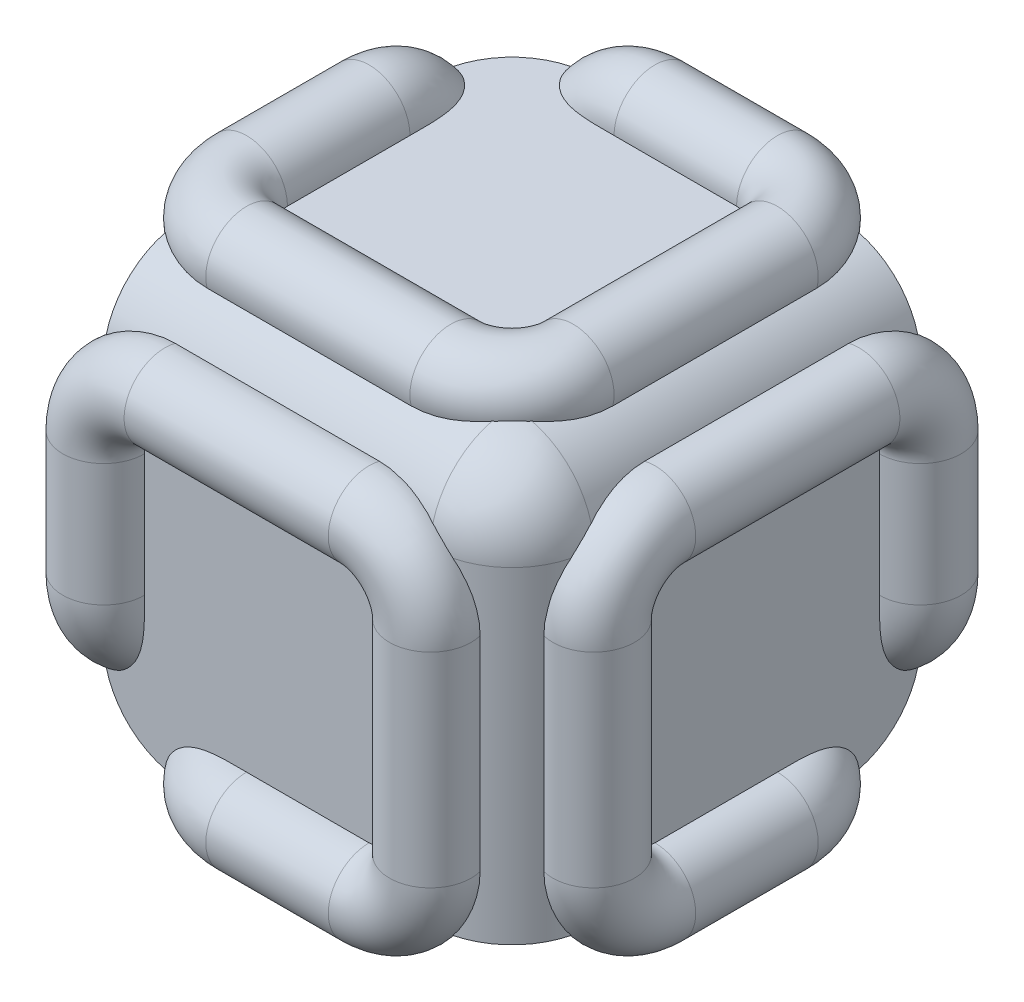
ISO-10303-21;
HEADER;
FILE_DESCRIPTION(('STEP AP214'),'2;1');
FILE_NAME('part.step','',(''),(''),'','','');
FILE_SCHEMA(('AUTOMOTIVE_DESIGN { 1 0 10303 214 1 1 1 1 }'));
ENDSEC;
DATA;
#1=APPLICATION_CONTEXT('core data for automotive mechanical design processes');
#2=APPLICATION_PROTOCOL_DEFINITION('international standard','automotive_design',2000,#1);
#3=PRODUCT_CONTEXT('',#1,'mechanical');
#4=PRODUCT('Part','Part','',(#3));
#5=PRODUCT_RELATED_PRODUCT_CATEGORY('part','',(#4));
#6=PRODUCT_DEFINITION_FORMATION('','',#4);
#7=PRODUCT_DEFINITION_CONTEXT('part definition',#1,'design');
#8=PRODUCT_DEFINITION('design','',#6,#7);
#9=PRODUCT_DEFINITION_SHAPE('','',#8);
#10=(LENGTH_UNIT() NAMED_UNIT(*) SI_UNIT(.MILLI.,.METRE.));
#11=(NAMED_UNIT(*) PLANE_ANGLE_UNIT() SI_UNIT($,.RADIAN.));
#12=(NAMED_UNIT(*) SI_UNIT($,.STERADIAN.) SOLID_ANGLE_UNIT());
#13=UNCERTAINTY_MEASURE_WITH_UNIT(LENGTH_MEASURE(1.E-05),#10,'distance_accuracy_value','');
#14=(GEOMETRIC_REPRESENTATION_CONTEXT(3) GLOBAL_UNCERTAINTY_ASSIGNED_CONTEXT((#13)) GLOBAL_UNIT_ASSIGNED_CONTEXT((#10,
#11,#12)) REPRESENTATION_CONTEXT('',''));
#15=CARTESIAN_POINT('',(0.,0.,0.));
#16=DIRECTION('',(0.,0.,1.));
#17=DIRECTION('',(1.,0.,0.));
#18=AXIS2_PLACEMENT_3D('',#15,#16,#17);
#19=CARTESIAN_POINT('',(20.,35.,-100.));
#20=DIRECTION('',(0.,1.,0.));
#21=DIRECTION('',(0.,0.,1.));
#22=AXIS2_PLACEMENT_3D('',#19,#20,#21);
#23=CYLINDRICAL_SURFACE('',#22,10.);
#24=CARTESIAN_POINT('',(20.,85.,-100.));
#25=DIRECTION('',(0.,-1.,0.));
#26=DIRECTION('',(0.,0.,-1.));
#27=AXIS2_PLACEMENT_3D('',#24,#25,#26);
#28=CIRCLE('',#27,10.);
#29=CARTESIAN_POINT('',(10.,85.,-100.));
#30=VERTEX_POINT('',#29);
#31=EDGE_CURVE('E153',#30,#30,#28,.T.);
#32=ORIENTED_EDGE('',*,*,#31,.T.);
#33=EDGE_LOOP('',(#32));
#34=FACE_BOUND('',#33,.T.);
#35=CARTESIAN_POINT('',(20.,35.,-100.));
#36=DIRECTION('',(0.,-1.,0.));
#37=DIRECTION('',(0.,0.,-1.));
#38=AXIS2_PLACEMENT_3D('',#35,#36,#37);
#39=CIRCLE('',#38,10.);
#40=CARTESIAN_POINT('',(10.,35.,-100.));
#41=VERTEX_POINT('',#40);
#42=EDGE_CURVE('E156',#41,#41,#39,.T.);
#43=ORIENTED_EDGE('',*,*,#42,.F.);
#44=EDGE_LOOP('',(#43));
#45=FACE_BOUND('',#44,.T.);
#46=ADVANCED_FACE('F43',(#34,#45),#23,.T.);
#47=CARTESIAN_POINT('',(35.,85.,-100.));
#48=DIRECTION('',(0.,0.,-1.));
#49=DIRECTION('',(-1.,0.,0.));
#50=AXIS2_PLACEMENT_3D('',#47,#48,#49);
#51=TOROIDAL_SURFACE('',#50,15.,10.);
#52=CARTESIAN_POINT('',(35.,100.,-100.));
#53=DIRECTION('',(-1.,0.,0.));
#54=DIRECTION('',(0.,0.,-1.));
#55=AXIS2_PLACEMENT_3D('',#52,#53,#54);
#56=CIRCLE('',#55,10.);
#57=CARTESIAN_POINT('',(35.,110.,-100.));
#58=VERTEX_POINT('',#57);
#59=EDGE_CURVE('E150',#58,#58,#56,.T.);
#60=CARTESIAN_POINT('',(35.,85.,-100.));
#61=DIRECTION('',(0.,0.,-1.));
#62=DIRECTION('',(-1.,0.,0.));
#63=AXIS2_PLACEMENT_3D('',#60,#61,#62);
#64=CIRCLE('',#63,25.);
#65=EDGE_CURVE('',#30,#58,#64,.T.);
#66=ORIENTED_EDGE('',*,*,#31,.F.);
#67=ORIENTED_EDGE('',*,*,#59,.T.);
#68=ORIENTED_EDGE('',*,*,#65,.T.);
#69=ORIENTED_EDGE('',*,*,#65,.F.);
#70=EDGE_LOOP('',(#66,#68,#67,#69));
#71=FACE_BOUND('',#70,.T.);
#72=ADVANCED_FACE('F163',(#71),#51,.T.);
#73=CARTESIAN_POINT('',(35.,100.,-100.));
#74=DIRECTION('',(1.,0.,0.));
#75=DIRECTION('',(0.,0.,-1.));
#76=AXIS2_PLACEMENT_3D('',#73,#74,#75);
#77=CYLINDRICAL_SURFACE('',#76,10.);
#78=CARTESIAN_POINT('',(65.,100.,-100.));
#79=DIRECTION('',(-1.,0.,0.));
#80=DIRECTION('',(0.,0.,-1.));
#81=AXIS2_PLACEMENT_3D('',#78,#79,#80);
#82=CIRCLE('',#81,10.);
#83=CARTESIAN_POINT('',(65.,100.,-110.));
#84=VERTEX_POINT('',#83);
#85=EDGE_CURVE('E147',#84,#84,#82,.T.);
#86=ORIENTED_EDGE('',*,*,#85,.T.);
#87=EDGE_LOOP('',(#86));
#88=FACE_BOUND('',#87,.T.);
#89=ORIENTED_EDGE('',*,*,#59,.F.);
#90=EDGE_LOOP('',(#89));
#91=FACE_BOUND('',#90,.T.);
#92=ADVANCED_FACE('F169',(#88,#91),#77,.T.);
#93=CARTESIAN_POINT('',(65.,100.,-85.));
#94=DIRECTION('',(0.,-1.,0.));
#95=DIRECTION('',(0.,0.,-1.));
#96=AXIS2_PLACEMENT_3D('',#93,#94,#95);
#97=TOROIDAL_SURFACE('',#96,15.,10.);
#98=CARTESIAN_POINT('',(80.,100.,-85.));
#99=DIRECTION('',(0.,0.,-1.));
#100=DIRECTION('',(1.,0.,0.));
#101=AXIS2_PLACEMENT_3D('',#98,#99,#100);
#102=CIRCLE('',#101,10.);
#103=CARTESIAN_POINT('',(90.,100.,-85.));
#104=VERTEX_POINT('',#103);
#105=EDGE_CURVE('E144',#104,#104,#102,.T.);
#106=CARTESIAN_POINT('',(65.,100.,-85.));
#107=DIRECTION('',(0.,-1.,0.));
#108=DIRECTION('',(0.,0.,-1.));
#109=AXIS2_PLACEMENT_3D('',#106,#107,#108);
#110=CIRCLE('',#109,25.);
#111=EDGE_CURVE('',#84,#104,#110,.T.);
#112=ORIENTED_EDGE('',*,*,#85,.F.);
#113=ORIENTED_EDGE('',*,*,#105,.T.);
#114=ORIENTED_EDGE('',*,*,#111,.T.);
#115=ORIENTED_EDGE('',*,*,#111,.F.);
#116=EDGE_LOOP('',(#112,#114,#113,#115));
#117=FACE_BOUND('',#116,.T.);
#118=ADVANCED_FACE('F175',(#117),#97,.T.);
#119=CARTESIAN_POINT('',(80.,100.,-85.));
#120=DIRECTION('',(0.,0.,1.));
#121=DIRECTION('',(1.,0.,0.));
#122=AXIS2_PLACEMENT_3D('',#119,#120,#121);
#123=CYLINDRICAL_SURFACE('',#122,10.);
#124=CARTESIAN_POINT('',(80.,100.,-35.));
#125=DIRECTION('',(0.,0.,-1.));
#126=DIRECTION('',(1.,0.,0.));
#127=AXIS2_PLACEMENT_3D('',#124,#125,#126);
#128=CIRCLE('',#127,10.);
#129=CARTESIAN_POINT('',(90.,100.,-35.));
#130=VERTEX_POINT('',#129);
#131=EDGE_CURVE('E141',#130,#130,#128,.T.);
#132=ORIENTED_EDGE('',*,*,#131,.T.);
#133=EDGE_LOOP('',(#132));
#134=FACE_BOUND('',#133,.T.);
#135=ORIENTED_EDGE('',*,*,#105,.F.);
#136=EDGE_LOOP('',(#135));
#137=FACE_BOUND('',#136,.T.);
#138=ADVANCED_FACE('F179',(#134,#137),#123,.T.);
#139=CARTESIAN_POINT('',(65.,100.,-35.));
#140=DIRECTION('',(0.,-1.,0.));
#141=DIRECTION('',(0.,0.,-1.));
#142=AXIS2_PLACEMENT_3D('',#139,#140,#141);
#143=TOROIDAL_SURFACE('',#142,15.,10.);
#144=CARTESIAN_POINT('',(65.,100.,-20.));
#145=DIRECTION('',(1.,0.,0.));
#146=DIRECTION('',(0.,0.,1.));
#147=AXIS2_PLACEMENT_3D('',#144,#145,#146);
#148=CIRCLE('',#147,10.);
#149=CARTESIAN_POINT('',(65.,100.,-10.));
#150=VERTEX_POINT('',#149);
#151=EDGE_CURVE('E138',#150,#150,#148,.T.);
#152=CARTESIAN_POINT('',(65.,100.,-35.));
#153=DIRECTION('',(0.,-1.,0.));
#154=DIRECTION('',(0.,0.,-1.));
#155=AXIS2_PLACEMENT_3D('',#152,#153,#154);
#156=CIRCLE('',#155,25.);
#157=EDGE_CURVE('',#130,#150,#156,.T.);
#158=ORIENTED_EDGE('',*,*,#131,.F.);
#159=ORIENTED_EDGE('',*,*,#151,.T.);
#160=ORIENTED_EDGE('',*,*,#157,.T.);
#161=ORIENTED_EDGE('',*,*,#157,.F.);
#162=EDGE_LOOP('',(#158,#160,#159,#161));
#163=FACE_BOUND('',#162,.T.);
#164=ADVANCED_FACE('F183',(#163),#143,.T.);
#165=CARTESIAN_POINT('',(65.,100.,-20.));
#166=DIRECTION('',(-1.,0.,0.));
#167=DIRECTION('',(0.,0.,1.));
#168=AXIS2_PLACEMENT_3D('',#165,#166,#167);
#169=CYLINDRICAL_SURFACE('',#168,10.);
#170=CARTESIAN_POINT('',(15.,100.,-20.));
#171=DIRECTION('',(1.,0.,0.));
#172=DIRECTION('',(0.,0.,1.));
#173=AXIS2_PLACEMENT_3D('',#170,#171,#172);
#174=CIRCLE('',#173,10.);
#175=CARTESIAN_POINT('',(15.,100.,-10.));
#176=VERTEX_POINT('',#175);
#177=EDGE_CURVE('E135',#176,#176,#174,.T.);
#178=ORIENTED_EDGE('',*,*,#177,.T.);
#179=EDGE_LOOP('',(#178));
#180=FACE_BOUND('',#179,.T.);
#181=ORIENTED_EDGE('',*,*,#151,.F.);
#182=EDGE_LOOP('',(#181));
#183=FACE_BOUND('',#182,.T.);
#184=ADVANCED_FACE('F187',(#180,#183),#169,.T.);
#185=CARTESIAN_POINT('',(15.,100.,-35.));
#186=DIRECTION('',(0.,-1.,0.));
#187=DIRECTION('',(0.,0.,-1.));
#188=AXIS2_PLACEMENT_3D('',#185,#186,#187);
#189=TOROIDAL_SURFACE('',#188,15.,10.);
#190=CARTESIAN_POINT('',(0.,100.,-35.));
#191=DIRECTION('',(0.,0.,1.));
#192=DIRECTION('',(-1.,0.,0.));
#193=AXIS2_PLACEMENT_3D('',#190,#191,#192);
#194=CIRCLE('',#193,10.);
#195=CARTESIAN_POINT('',(-10.,100.,-35.));
#196=VERTEX_POINT('',#195);
#197=EDGE_CURVE('E132',#196,#196,#194,.T.);
#198=CARTESIAN_POINT('',(15.,100.,-35.));
#199=DIRECTION('',(0.,-1.,0.));
#200=DIRECTION('',(0.,0.,-1.));
#201=AXIS2_PLACEMENT_3D('',#198,#199,#200);
#202=CIRCLE('',#201,25.);
#203=EDGE_CURVE('',#176,#196,#202,.T.);
#204=ORIENTED_EDGE('',*,*,#177,.F.);
#205=ORIENTED_EDGE('',*,*,#197,.T.);
#206=ORIENTED_EDGE('',*,*,#203,.T.);
#207=ORIENTED_EDGE('',*,*,#203,.F.);
#208=EDGE_LOOP('',(#204,#206,#205,#207));
#209=FACE_BOUND('',#208,.T.);
#210=ADVANCED_FACE('F191',(#209),#189,.T.);
#211=CARTESIAN_POINT('',(0.,100.,-35.));
#212=DIRECTION('',(0.,0.,-1.));
#213=DIRECTION('',(-1.,0.,0.));
#214=AXIS2_PLACEMENT_3D('',#211,#212,#213);
#215=CYLINDRICAL_SURFACE('',#214,10.);
#216=CARTESIAN_POINT('',(0.,100.,-65.));
#217=DIRECTION('',(0.,0.,1.));
#218=DIRECTION('',(-1.,0.,0.));
#219=AXIS2_PLACEMENT_3D('',#216,#217,#218);
#220=CIRCLE('',#219,10.);
#221=CARTESIAN_POINT('',(0.,110.,-65.));
#222=VERTEX_POINT('',#221);
#223=EDGE_CURVE('E129',#222,#222,#220,.T.);
#224=ORIENTED_EDGE('',*,*,#223,.T.);
#225=EDGE_LOOP('',(#224));
#226=FACE_BOUND('',#225,.T.);
#227=ORIENTED_EDGE('',*,*,#197,.F.);
#228=EDGE_LOOP('',(#227));
#229=FACE_BOUND('',#228,.T.);
#230=ADVANCED_FACE('F195',(#226,#229),#215,.T.);
#231=CARTESIAN_POINT('',(0.,85.,-65.));
#232=DIRECTION('',(-1.,0.,0.));
#233=DIRECTION('',(0.,0.,1.));
#234=AXIS2_PLACEMENT_3D('',#231,#232,#233);
#235=TOROIDAL_SURFACE('',#234,15.,10.);
#236=CARTESIAN_POINT('',(0.,85.,-80.));
#237=DIRECTION('',(0.,1.,0.));
#238=DIRECTION('',(-1.,0.,0.));
#239=AXIS2_PLACEMENT_3D('',#236,#237,#238);
#240=CIRCLE('',#239,10.);
#241=CARTESIAN_POINT('',(0.,85.,-90.));
#242=VERTEX_POINT('',#241);
#243=EDGE_CURVE('E126',#242,#242,#240,.T.);
#244=CARTESIAN_POINT('',(0.,85.,-65.));
#245=DIRECTION('',(-1.,0.,0.));
#246=DIRECTION('',(0.,0.,1.));
#247=AXIS2_PLACEMENT_3D('',#244,#245,#246);
#248=CIRCLE('',#247,25.);
#249=EDGE_CURVE('',#222,#242,#248,.T.);
#250=ORIENTED_EDGE('',*,*,#223,.F.);
#251=ORIENTED_EDGE('',*,*,#243,.T.);
#252=ORIENTED_EDGE('',*,*,#249,.T.);
#253=ORIENTED_EDGE('',*,*,#249,.F.);
#254=EDGE_LOOP('',(#250,#252,#251,#253));
#255=FACE_BOUND('',#254,.T.);
#256=ADVANCED_FACE('F199',(#255),#235,.T.);
#257=CARTESIAN_POINT('',(0.,85.,-80.));
#258=DIRECTION('',(0.,-1.,0.));
#259=DIRECTION('',(0.,0.,-1.));
#260=AXIS2_PLACEMENT_3D('',#257,#258,#259);
#261=CYLINDRICAL_SURFACE('',#260,10.);
#262=CARTESIAN_POINT('',(0.,35.,-80.));
#263=DIRECTION('',(0.,1.,0.));
#264=DIRECTION('',(-1.,0.,0.));
#265=AXIS2_PLACEMENT_3D('',#262,#263,#264);
#266=CIRCLE('',#265,10.);
#267=CARTESIAN_POINT('',(0.,35.,-90.));
#268=VERTEX_POINT('',#267);
#269=EDGE_CURVE('E123',#268,#268,#266,.T.);
#270=ORIENTED_EDGE('',*,*,#269,.T.);
#271=EDGE_LOOP('',(#270));
#272=FACE_BOUND('',#271,.T.);
#273=ORIENTED_EDGE('',*,*,#243,.F.);
#274=EDGE_LOOP('',(#273));
#275=FACE_BOUND('',#274,.T.);
#276=ADVANCED_FACE('F203',(#272,#275),#261,.T.);
#277=CARTESIAN_POINT('',(0.,35.,-65.));
#278=DIRECTION('',(-1.,0.,0.));
#279=DIRECTION('',(0.,0.,1.));
#280=AXIS2_PLACEMENT_3D('',#277,#278,#279);
#281=TOROIDAL_SURFACE('',#280,15.,10.);
#282=CARTESIAN_POINT('',(0.,20.,-65.));
#283=DIRECTION('',(0.,0.,-1.));
#284=DIRECTION('',(-1.,0.,0.));
#285=AXIS2_PLACEMENT_3D('',#282,#283,#284);
#286=CIRCLE('',#285,10.);
#287=CARTESIAN_POINT('',(0.,10.,-65.));
#288=VERTEX_POINT('',#287);
#289=EDGE_CURVE('E120',#288,#288,#286,.T.);
#290=CARTESIAN_POINT('',(0.,35.,-65.));
#291=DIRECTION('',(-1.,0.,0.));
#292=DIRECTION('',(0.,0.,1.));
#293=AXIS2_PLACEMENT_3D('',#290,#291,#292);
#294=CIRCLE('',#293,25.);
#295=EDGE_CURVE('',#268,#288,#294,.T.);
#296=ORIENTED_EDGE('',*,*,#269,.F.);
#297=ORIENTED_EDGE('',*,*,#289,.T.);
#298=ORIENTED_EDGE('',*,*,#295,.T.);
#299=ORIENTED_EDGE('',*,*,#295,.F.);
#300=EDGE_LOOP('',(#296,#298,#297,#299));
#301=FACE_BOUND('',#300,.T.);
#302=ADVANCED_FACE('F207',(#301),#281,.T.);
#303=CARTESIAN_POINT('',(0.,20.,-65.));
#304=DIRECTION('',(0.,0.,1.));
#305=DIRECTION('',(1.,0.,0.));
#306=AXIS2_PLACEMENT_3D('',#303,#304,#305);
#307=CYLINDRICAL_SURFACE('',#306,10.);
#308=CARTESIAN_POINT('',(0.,20.,-15.));
#309=DIRECTION('',(0.,0.,-1.));
#310=DIRECTION('',(-1.,0.,0.));
#311=AXIS2_PLACEMENT_3D('',#308,#309,#310);
#312=CIRCLE('',#311,10.);
#313=CARTESIAN_POINT('',(0.,10.,-15.));
#314=VERTEX_POINT('',#313);
#315=EDGE_CURVE('E117',#314,#314,#312,.T.);
#316=ORIENTED_EDGE('',*,*,#315,.T.);
#317=EDGE_LOOP('',(#316));
#318=FACE_BOUND('',#317,.T.);
#319=ORIENTED_EDGE('',*,*,#289,.F.);
#320=EDGE_LOOP('',(#319));
#321=FACE_BOUND('',#320,.T.);
#322=ADVANCED_FACE('F211',(#318,#321),#307,.T.);
#323=CARTESIAN_POINT('',(0.,35.,-15.));
#324=DIRECTION('',(-1.,0.,0.));
#325=DIRECTION('',(0.,0.,1.));
#326=AXIS2_PLACEMENT_3D('',#323,#324,#325);
#327=TOROIDAL_SURFACE('',#326,15.,10.);
#328=CARTESIAN_POINT('',(0.,35.,0.));
#329=DIRECTION('',(0.,-1.,0.));
#330=DIRECTION('',(-1.,0.,0.));
#331=AXIS2_PLACEMENT_3D('',#328,#329,#330);
#332=CIRCLE('',#331,10.);
#333=CARTESIAN_POINT('',(0.,35.,10.));
#334=VERTEX_POINT('',#333);
#335=EDGE_CURVE('E114',#334,#334,#332,.T.);
#336=CARTESIAN_POINT('',(0.,35.,-15.));
#337=DIRECTION('',(-1.,0.,0.));
#338=DIRECTION('',(0.,0.,1.));
#339=AXIS2_PLACEMENT_3D('',#336,#337,#338);
#340=CIRCLE('',#339,25.);
#341=EDGE_CURVE('',#314,#334,#340,.T.);
#342=ORIENTED_EDGE('',*,*,#315,.F.);
#343=ORIENTED_EDGE('',*,*,#335,.T.);
#344=ORIENTED_EDGE('',*,*,#341,.T.);
#345=ORIENTED_EDGE('',*,*,#341,.F.);
#346=EDGE_LOOP('',(#342,#344,#343,#345));
#347=FACE_BOUND('',#346,.T.);
#348=ADVANCED_FACE('F215',(#347),#327,.T.);
#349=CARTESIAN_POINT('',(0.,35.,0.));
#350=DIRECTION('',(0.,1.,0.));
#351=DIRECTION('',(0.,0.,1.));
#352=AXIS2_PLACEMENT_3D('',#349,#350,#351);
#353=CYLINDRICAL_SURFACE('',#352,10.);
#354=CARTESIAN_POINT('',(0.,65.,0.));
#355=DIRECTION('',(0.,-1.,0.));
#356=DIRECTION('',(-1.,0.,0.));
#357=AXIS2_PLACEMENT_3D('',#354,#355,#356);
#358=CIRCLE('',#357,10.);
#359=CARTESIAN_POINT('',(-10.,65.,0.));
#360=VERTEX_POINT('',#359);
#361=EDGE_CURVE('E111',#360,#360,#358,.T.);
#362=ORIENTED_EDGE('',*,*,#361,.T.);
#363=EDGE_LOOP('',(#362));
#364=FACE_BOUND('',#363,.T.);
#365=ORIENTED_EDGE('',*,*,#335,.F.);
#366=EDGE_LOOP('',(#365));
#367=FACE_BOUND('',#366,.T.);
#368=ADVANCED_FACE('F219',(#364,#367),#353,.T.);
#369=CARTESIAN_POINT('',(15.,65.,0.));
#370=DIRECTION('',(0.,0.,-1.));
#371=DIRECTION('',(-1.,0.,0.));
#372=AXIS2_PLACEMENT_3D('',#369,#370,#371);
#373=TOROIDAL_SURFACE('',#372,15.,10.);
#374=CARTESIAN_POINT('',(15.,80.,0.));
#375=DIRECTION('',(-1.,0.,0.));
#376=DIRECTION('',(0.,1.,0.));
#377=AXIS2_PLACEMENT_3D('',#374,#375,#376);
#378=CIRCLE('',#377,10.);
#379=CARTESIAN_POINT('',(15.,90.,0.));
#380=VERTEX_POINT('',#379);
#381=EDGE_CURVE('E108',#380,#380,#378,.T.);
#382=CARTESIAN_POINT('',(15.,65.,0.));
#383=DIRECTION('',(0.,0.,-1.));
#384=DIRECTION('',(-1.,0.,0.));
#385=AXIS2_PLACEMENT_3D('',#382,#383,#384);
#386=CIRCLE('',#385,25.);
#387=EDGE_CURVE('',#360,#380,#386,.T.);
#388=ORIENTED_EDGE('',*,*,#361,.F.);
#389=ORIENTED_EDGE('',*,*,#381,.T.);
#390=ORIENTED_EDGE('',*,*,#387,.T.);
#391=ORIENTED_EDGE('',*,*,#387,.F.);
#392=EDGE_LOOP('',(#388,#390,#389,#391));
#393=FACE_BOUND('',#392,.T.);
#394=ADVANCED_FACE('F223',(#393),#373,.T.);
#395=CARTESIAN_POINT('',(15.,80.,0.));
#396=DIRECTION('',(1.,0.,0.));
#397=DIRECTION('',(0.,0.,-1.));
#398=AXIS2_PLACEMENT_3D('',#395,#396,#397);
#399=CYLINDRICAL_SURFACE('',#398,10.);
#400=CARTESIAN_POINT('',(65.,80.,0.));
#401=DIRECTION('',(-1.,0.,0.));
#402=DIRECTION('',(0.,1.,0.));
#403=AXIS2_PLACEMENT_3D('',#400,#401,#402);
#404=CIRCLE('',#403,10.);
#405=CARTESIAN_POINT('',(65.,90.,0.));
#406=VERTEX_POINT('',#405);
#407=EDGE_CURVE('E105',#406,#406,#404,.T.);
#408=ORIENTED_EDGE('',*,*,#407,.T.);
#409=EDGE_LOOP('',(#408));
#410=FACE_BOUND('',#409,.T.);
#411=ORIENTED_EDGE('',*,*,#381,.F.);
#412=EDGE_LOOP('',(#411));
#413=FACE_BOUND('',#412,.T.);
#414=ADVANCED_FACE('F227',(#410,#413),#399,.T.);
#415=CARTESIAN_POINT('',(65.,65.,0.));
#416=DIRECTION('',(0.,0.,-1.));
#417=DIRECTION('',(-1.,0.,0.));
#418=AXIS2_PLACEMENT_3D('',#415,#416,#417);
#419=TOROIDAL_SURFACE('',#418,15.,10.);
#420=CARTESIAN_POINT('',(80.,65.,0.));
#421=DIRECTION('',(0.,1.,0.));
#422=DIRECTION('',(1.,0.,0.));
#423=AXIS2_PLACEMENT_3D('',#420,#421,#422);
#424=CIRCLE('',#423,10.);
#425=CARTESIAN_POINT('',(90.,65.,0.));
#426=VERTEX_POINT('',#425);
#427=EDGE_CURVE('E102',#426,#426,#424,.T.);
#428=CARTESIAN_POINT('',(65.,65.,0.));
#429=DIRECTION('',(0.,0.,-1.));
#430=DIRECTION('',(-1.,0.,0.));
#431=AXIS2_PLACEMENT_3D('',#428,#429,#430);
#432=CIRCLE('',#431,25.);
#433=EDGE_CURVE('',#406,#426,#432,.T.);
#434=ORIENTED_EDGE('',*,*,#407,.F.);
#435=ORIENTED_EDGE('',*,*,#427,.T.);
#436=ORIENTED_EDGE('',*,*,#433,.T.);
#437=ORIENTED_EDGE('',*,*,#433,.F.);
#438=EDGE_LOOP('',(#434,#436,#435,#437));
#439=FACE_BOUND('',#438,.T.);
#440=ADVANCED_FACE('F231',(#439),#419,.T.);
#441=CARTESIAN_POINT('',(80.,65.,0.));
#442=DIRECTION('',(0.,-1.,0.));
#443=DIRECTION('',(0.,0.,-1.));
#444=AXIS2_PLACEMENT_3D('',#441,#442,#443);
#445=CYLINDRICAL_SURFACE('',#444,10.);
#446=CARTESIAN_POINT('',(80.,15.,0.));
#447=DIRECTION('',(0.,1.,0.));
#448=DIRECTION('',(1.,0.,0.));
#449=AXIS2_PLACEMENT_3D('',#446,#447,#448);
#450=CIRCLE('',#449,10.);
#451=CARTESIAN_POINT('',(90.,15.,0.));
#452=VERTEX_POINT('',#451);
#453=EDGE_CURVE('E99',#452,#452,#450,.T.);
#454=ORIENTED_EDGE('',*,*,#453,.T.);
#455=EDGE_LOOP('',(#454));
#456=FACE_BOUND('',#455,.T.);
#457=ORIENTED_EDGE('',*,*,#427,.F.);
#458=EDGE_LOOP('',(#457));
#459=FACE_BOUND('',#458,.T.);
#460=ADVANCED_FACE('F235',(#456,#459),#445,.T.);
#461=CARTESIAN_POINT('',(65.,15.,0.));
#462=DIRECTION('',(0.,0.,-1.));
#463=DIRECTION('',(-1.,0.,0.));
#464=AXIS2_PLACEMENT_3D('',#461,#462,#463);
#465=TOROIDAL_SURFACE('',#464,15.,10.);
#466=CARTESIAN_POINT('',(65.,0.,0.));
#467=DIRECTION('',(1.,0.,0.));
#468=DIRECTION('',(0.,-1.,0.));
#469=AXIS2_PLACEMENT_3D('',#466,#467,#468);
#470=CIRCLE('',#469,10.);
#471=CARTESIAN_POINT('',(65.,-10.,0.));
#472=VERTEX_POINT('',#471);
#473=EDGE_CURVE('E96',#472,#472,#470,.T.);
#474=CARTESIAN_POINT('',(65.,15.,0.));
#475=DIRECTION('',(0.,0.,-1.));
#476=DIRECTION('',(-1.,0.,0.));
#477=AXIS2_PLACEMENT_3D('',#474,#475,#476);
#478=CIRCLE('',#477,25.);
#479=EDGE_CURVE('',#452,#472,#478,.T.);
#480=ORIENTED_EDGE('',*,*,#453,.F.);
#481=ORIENTED_EDGE('',*,*,#473,.T.);
#482=ORIENTED_EDGE('',*,*,#479,.T.);
#483=ORIENTED_EDGE('',*,*,#479,.F.);
#484=EDGE_LOOP('',(#480,#482,#481,#483));
#485=FACE_BOUND('',#484,.T.);
#486=ADVANCED_FACE('F239',(#485),#465,.T.);
#487=CARTESIAN_POINT('',(65.,0.,0.));
#488=DIRECTION('',(-1.,0.,0.));
#489=DIRECTION('',(0.,0.,1.));
#490=AXIS2_PLACEMENT_3D('',#487,#488,#489);
#491=CYLINDRICAL_SURFACE('',#490,10.);
#492=CARTESIAN_POINT('',(35.,0.,0.));
#493=DIRECTION('',(1.,0.,0.));
#494=DIRECTION('',(0.,-1.,0.));
#495=AXIS2_PLACEMENT_3D('',#492,#493,#494);
#496=CIRCLE('',#495,10.);
#497=CARTESIAN_POINT('',(35.,0.,10.));
#498=VERTEX_POINT('',#497);
#499=EDGE_CURVE('E93',#498,#498,#496,.T.);
#500=ORIENTED_EDGE('',*,*,#499,.T.);
#501=EDGE_LOOP('',(#500));
#502=FACE_BOUND('',#501,.T.);
#503=ORIENTED_EDGE('',*,*,#473,.F.);
#504=EDGE_LOOP('',(#503));
#505=FACE_BOUND('',#504,.T.);
#506=ADVANCED_FACE('F243',(#502,#505),#491,.T.);
#507=CARTESIAN_POINT('',(35.,0.,-15.));
#508=DIRECTION('',(0.,-1.,0.));
#509=DIRECTION('',(0.,0.,-1.));
#510=AXIS2_PLACEMENT_3D('',#507,#508,#509);
#511=TOROIDAL_SURFACE('',#510,15.,10.);
#512=CARTESIAN_POINT('',(20.,0.,-15.));
#513=DIRECTION('',(0.,0.,1.));
#514=DIRECTION('',(0.,-1.,0.));
#515=AXIS2_PLACEMENT_3D('',#512,#513,#514);
#516=CIRCLE('',#515,10.);
#517=CARTESIAN_POINT('',(10.,0.,-15.));
#518=VERTEX_POINT('',#517);
#519=EDGE_CURVE('E90',#518,#518,#516,.T.);
#520=CARTESIAN_POINT('',(35.,0.,-15.));
#521=DIRECTION('',(0.,-1.,0.));
#522=DIRECTION('',(0.,0.,-1.));
#523=AXIS2_PLACEMENT_3D('',#520,#521,#522);
#524=CIRCLE('',#523,25.);
#525=EDGE_CURVE('',#498,#518,#524,.T.);
#526=ORIENTED_EDGE('',*,*,#499,.F.);
#527=ORIENTED_EDGE('',*,*,#519,.T.);
#528=ORIENTED_EDGE('',*,*,#525,.T.);
#529=ORIENTED_EDGE('',*,*,#525,.F.);
#530=EDGE_LOOP('',(#526,#528,#527,#529));
#531=FACE_BOUND('',#530,.T.);
#532=ADVANCED_FACE('F247',(#531),#511,.T.);
#533=CARTESIAN_POINT('',(20.,0.,-15.));
#534=DIRECTION('',(0.,0.,-1.));
#535=DIRECTION('',(-1.,0.,0.));
#536=AXIS2_PLACEMENT_3D('',#533,#534,#535);
#537=CYLINDRICAL_SURFACE('',#536,10.);
#538=CARTESIAN_POINT('',(20.,0.,-65.));
#539=DIRECTION('',(0.,0.,1.));
#540=DIRECTION('',(0.,-1.,0.));
#541=AXIS2_PLACEMENT_3D('',#538,#539,#540);
#542=CIRCLE('',#541,10.);
#543=CARTESIAN_POINT('',(10.,0.,-65.));
#544=VERTEX_POINT('',#543);
#545=EDGE_CURVE('E87',#544,#544,#542,.T.);
#546=ORIENTED_EDGE('',*,*,#545,.T.);
#547=EDGE_LOOP('',(#546));
#548=FACE_BOUND('',#547,.T.);
#549=ORIENTED_EDGE('',*,*,#519,.F.);
#550=EDGE_LOOP('',(#549));
#551=FACE_BOUND('',#550,.T.);
#552=ADVANCED_FACE('F251',(#548,#551),#537,.T.);
#553=CARTESIAN_POINT('',(35.,0.,-65.));
#554=DIRECTION('',(0.,-1.,0.));
#555=DIRECTION('',(0.,0.,-1.));
#556=AXIS2_PLACEMENT_3D('',#553,#554,#555);
#557=TOROIDAL_SURFACE('',#556,15.,10.);
#558=CARTESIAN_POINT('',(35.,0.,-80.));
#559=DIRECTION('',(-1.,0.,0.));
#560=DIRECTION('',(0.,-1.,0.));
#561=AXIS2_PLACEMENT_3D('',#558,#559,#560);
#562=CIRCLE('',#561,10.);
#563=CARTESIAN_POINT('',(35.,0.,-90.));
#564=VERTEX_POINT('',#563);
#565=EDGE_CURVE('E84',#564,#564,#562,.T.);
#566=CARTESIAN_POINT('',(35.,0.,-65.));
#567=DIRECTION('',(0.,-1.,0.));
#568=DIRECTION('',(0.,0.,-1.));
#569=AXIS2_PLACEMENT_3D('',#566,#567,#568);
#570=CIRCLE('',#569,25.);
#571=EDGE_CURVE('',#544,#564,#570,.T.);
#572=ORIENTED_EDGE('',*,*,#545,.F.);
#573=ORIENTED_EDGE('',*,*,#565,.T.);
#574=ORIENTED_EDGE('',*,*,#571,.T.);
#575=ORIENTED_EDGE('',*,*,#571,.F.);
#576=EDGE_LOOP('',(#572,#574,#573,#575));
#577=FACE_BOUND('',#576,.T.);
#578=ADVANCED_FACE('F255',(#577),#557,.T.);
#579=CARTESIAN_POINT('',(35.,0.,-80.));
#580=DIRECTION('',(1.,0.,0.));
#581=DIRECTION('',(0.,0.,-1.));
#582=AXIS2_PLACEMENT_3D('',#579,#580,#581);
#583=CYLINDRICAL_SURFACE('',#582,10.);
#584=CARTESIAN_POINT('',(85.,0.,-80.));
#585=DIRECTION('',(-1.,0.,0.));
#586=DIRECTION('',(0.,-1.,0.));
#587=AXIS2_PLACEMENT_3D('',#584,#585,#586);
#588=CIRCLE('',#587,10.);
#589=CARTESIAN_POINT('',(85.,0.,-90.));
#590=VERTEX_POINT('',#589);
#591=EDGE_CURVE('E81',#590,#590,#588,.T.);
#592=ORIENTED_EDGE('',*,*,#591,.T.);
#593=EDGE_LOOP('',(#592));
#594=FACE_BOUND('',#593,.T.);
#595=ORIENTED_EDGE('',*,*,#565,.F.);
#596=EDGE_LOOP('',(#595));
#597=FACE_BOUND('',#596,.T.);
#598=ADVANCED_FACE('F259',(#594,#597),#583,.T.);
#599=CARTESIAN_POINT('',(85.,0.,-65.));
#600=DIRECTION('',(0.,-1.,0.));
#601=DIRECTION('',(0.,0.,-1.));
#602=AXIS2_PLACEMENT_3D('',#599,#600,#601);
#603=TOROIDAL_SURFACE('',#602,15.,10.);
#604=CARTESIAN_POINT('',(100.,0.,-65.));
#605=DIRECTION('',(0.,0.,-1.));
#606=DIRECTION('',(0.,-1.,0.));
#607=AXIS2_PLACEMENT_3D('',#604,#605,#606);
#608=CIRCLE('',#607,10.);
#609=CARTESIAN_POINT('',(110.,0.,-65.));
#610=VERTEX_POINT('',#609);
#611=EDGE_CURVE('E78',#610,#610,#608,.T.);
#612=CARTESIAN_POINT('',(85.,0.,-65.));
#613=DIRECTION('',(0.,-1.,0.));
#614=DIRECTION('',(0.,0.,-1.));
#615=AXIS2_PLACEMENT_3D('',#612,#613,#614);
#616=CIRCLE('',#615,25.);
#617=EDGE_CURVE('',#590,#610,#616,.T.);
#618=ORIENTED_EDGE('',*,*,#591,.F.);
#619=ORIENTED_EDGE('',*,*,#611,.T.);
#620=ORIENTED_EDGE('',*,*,#617,.T.);
#621=ORIENTED_EDGE('',*,*,#617,.F.);
#622=EDGE_LOOP('',(#618,#620,#619,#621));
#623=FACE_BOUND('',#622,.T.);
#624=ADVANCED_FACE('F263',(#623),#603,.T.);
#625=CARTESIAN_POINT('',(100.,0.,-65.));
#626=DIRECTION('',(0.,0.,1.));
#627=DIRECTION('',(1.,0.,0.));
#628=AXIS2_PLACEMENT_3D('',#625,#626,#627);
#629=CYLINDRICAL_SURFACE('',#628,10.);
#630=CARTESIAN_POINT('',(100.,0.,-35.));
#631=DIRECTION('',(0.,0.,-1.));
#632=DIRECTION('',(0.,-1.,0.));
#633=AXIS2_PLACEMENT_3D('',#630,#631,#632);
#634=CIRCLE('',#633,10.);
#635=CARTESIAN_POINT('',(100.,-10.,-35.));
#636=VERTEX_POINT('',#635);
#637=EDGE_CURVE('E75',#636,#636,#634,.T.);
#638=ORIENTED_EDGE('',*,*,#637,.T.);
#639=EDGE_LOOP('',(#638));
#640=FACE_BOUND('',#639,.T.);
#641=ORIENTED_EDGE('',*,*,#611,.F.);
#642=EDGE_LOOP('',(#641));
#643=FACE_BOUND('',#642,.T.);
#644=ADVANCED_FACE('F267',(#640,#643),#629,.T.);
#645=CARTESIAN_POINT('',(100.,15.,-35.));
#646=DIRECTION('',(-1.,0.,0.));
#647=DIRECTION('',(0.,0.,1.));
#648=AXIS2_PLACEMENT_3D('',#645,#646,#647);
#649=TOROIDAL_SURFACE('',#648,15.,10.);
#650=CARTESIAN_POINT('',(100.,15.,-20.));
#651=DIRECTION('',(0.,-1.,0.));
#652=DIRECTION('',(0.,0.,1.));
#653=AXIS2_PLACEMENT_3D('',#650,#651,#652);
#654=CIRCLE('',#653,10.);
#655=CARTESIAN_POINT('',(100.,15.,-10.));
#656=VERTEX_POINT('',#655);
#657=EDGE_CURVE('E72',#656,#656,#654,.T.);
#658=CARTESIAN_POINT('',(100.,15.,-35.));
#659=DIRECTION('',(-1.,0.,0.));
#660=DIRECTION('',(0.,0.,1.));
#661=AXIS2_PLACEMENT_3D('',#658,#659,#660);
#662=CIRCLE('',#661,25.);
#663=EDGE_CURVE('',#636,#656,#662,.T.);
#664=ORIENTED_EDGE('',*,*,#637,.F.);
#665=ORIENTED_EDGE('',*,*,#657,.T.);
#666=ORIENTED_EDGE('',*,*,#663,.T.);
#667=ORIENTED_EDGE('',*,*,#663,.F.);
#668=EDGE_LOOP('',(#664,#666,#665,#667));
#669=FACE_BOUND('',#668,.T.);
#670=ADVANCED_FACE('F271',(#669),#649,.T.);
#671=CARTESIAN_POINT('',(100.,15.,-20.));
#672=DIRECTION('',(0.,1.,0.));
#673=DIRECTION('',(0.,0.,1.));
#674=AXIS2_PLACEMENT_3D('',#671,#672,#673);
#675=CYLINDRICAL_SURFACE('',#674,10.);
#676=CARTESIAN_POINT('',(100.,65.,-20.));
#677=DIRECTION('',(0.,-1.,0.));
#678=DIRECTION('',(0.,0.,1.));
#679=AXIS2_PLACEMENT_3D('',#676,#677,#678);
#680=CIRCLE('',#679,10.);
#681=CARTESIAN_POINT('',(100.,65.,-10.));
#682=VERTEX_POINT('',#681);
#683=EDGE_CURVE('E69',#682,#682,#680,.T.);
#684=ORIENTED_EDGE('',*,*,#683,.T.);
#685=EDGE_LOOP('',(#684));
#686=FACE_BOUND('',#685,.T.);
#687=ORIENTED_EDGE('',*,*,#657,.F.);
#688=EDGE_LOOP('',(#687));
#689=FACE_BOUND('',#688,.T.);
#690=ADVANCED_FACE('F275',(#686,#689),#675,.T.);
#691=CARTESIAN_POINT('',(100.,65.,-35.));
#692=DIRECTION('',(-1.,0.,0.));
#693=DIRECTION('',(0.,0.,1.));
#694=AXIS2_PLACEMENT_3D('',#691,#692,#693);
#695=TOROIDAL_SURFACE('',#694,15.,10.);
#696=CARTESIAN_POINT('',(100.,80.,-35.));
#697=DIRECTION('',(0.,0.,1.));
#698=DIRECTION('',(0.,1.,0.));
#699=AXIS2_PLACEMENT_3D('',#696,#697,#698);
#700=CIRCLE('',#699,10.);
#701=CARTESIAN_POINT('',(100.,90.,-35.));
#702=VERTEX_POINT('',#701);
#703=EDGE_CURVE('E66',#702,#702,#700,.T.);
#704=CARTESIAN_POINT('',(100.,65.,-35.));
#705=DIRECTION('',(-1.,0.,0.));
#706=DIRECTION('',(0.,0.,1.));
#707=AXIS2_PLACEMENT_3D('',#704,#705,#706);
#708=CIRCLE('',#707,25.);
#709=EDGE_CURVE('',#682,#702,#708,.T.);
#710=ORIENTED_EDGE('',*,*,#683,.F.);
#711=ORIENTED_EDGE('',*,*,#703,.T.);
#712=ORIENTED_EDGE('',*,*,#709,.T.);
#713=ORIENTED_EDGE('',*,*,#709,.F.);
#714=EDGE_LOOP('',(#710,#712,#711,#713));
#715=FACE_BOUND('',#714,.T.);
#716=ADVANCED_FACE('F279',(#715),#695,.T.);
#717=CARTESIAN_POINT('',(100.,80.,-35.));
#718=DIRECTION('',(0.,0.,-1.));
#719=DIRECTION('',(-1.,0.,0.));
#720=AXIS2_PLACEMENT_3D('',#717,#718,#719);
#721=CYLINDRICAL_SURFACE('',#720,10.);
#722=CARTESIAN_POINT('',(100.,80.,-85.));
#723=DIRECTION('',(0.,0.,1.));
#724=DIRECTION('',(0.,1.,0.));
#725=AXIS2_PLACEMENT_3D('',#722,#723,#724);
#726=CIRCLE('',#725,10.);
#727=CARTESIAN_POINT('',(100.,90.,-85.));
#728=VERTEX_POINT('',#727);
#729=EDGE_CURVE('E63',#728,#728,#726,.T.);
#730=ORIENTED_EDGE('',*,*,#729,.T.);
#731=EDGE_LOOP('',(#730));
#732=FACE_BOUND('',#731,.T.);
#733=ORIENTED_EDGE('',*,*,#703,.F.);
#734=EDGE_LOOP('',(#733));
#735=FACE_BOUND('',#734,.T.);
#736=ADVANCED_FACE('F283',(#732,#735),#721,.T.);
#737=CARTESIAN_POINT('',(100.,65.,-85.));
#738=DIRECTION('',(-1.,0.,0.));
#739=DIRECTION('',(0.,0.,1.));
#740=AXIS2_PLACEMENT_3D('',#737,#738,#739);
#741=TOROIDAL_SURFACE('',#740,15.,10.);
#742=CARTESIAN_POINT('',(100.,65.,-100.));
#743=DIRECTION('',(0.,1.,0.));
#744=DIRECTION('',(0.,0.,-1.));
#745=AXIS2_PLACEMENT_3D('',#742,#743,#744);
#746=CIRCLE('',#745,10.);
#747=CARTESIAN_POINT('',(100.,65.,-110.));
#748=VERTEX_POINT('',#747);
#749=EDGE_CURVE('E58',#748,#748,#746,.T.);
#750=CARTESIAN_POINT('',(100.,65.,-85.));
#751=DIRECTION('',(-1.,0.,0.));
#752=DIRECTION('',(0.,0.,1.));
#753=AXIS2_PLACEMENT_3D('',#750,#751,#752);
#754=CIRCLE('',#753,25.);
#755=EDGE_CURVE('',#728,#748,#754,.T.);
#756=ORIENTED_EDGE('',*,*,#729,.F.);
#757=ORIENTED_EDGE('',*,*,#749,.T.);
#758=ORIENTED_EDGE('',*,*,#755,.T.);
#759=ORIENTED_EDGE('',*,*,#755,.F.);
#760=EDGE_LOOP('',(#756,#758,#757,#759));
#761=FACE_BOUND('',#760,.T.);
#762=ADVANCED_FACE('F287',(#761),#741,.T.);
#763=CARTESIAN_POINT('',(100.,65.,-100.));
#764=DIRECTION('',(0.,-1.,0.));
#765=DIRECTION('',(0.,0.,-1.));
#766=AXIS2_PLACEMENT_3D('',#763,#764,#765);
#767=CYLINDRICAL_SURFACE('',#766,10.);
#768=CARTESIAN_POINT('',(100.,35.,-100.));
#769=DIRECTION('',(0.,1.,0.));
#770=DIRECTION('',(0.,0.,-1.));
#771=AXIS2_PLACEMENT_3D('',#768,#769,#770);
#772=CIRCLE('',#771,10.);
#773=CARTESIAN_POINT('',(110.,35.,-100.));
#774=VERTEX_POINT('',#773);
#775=EDGE_CURVE('E54',#774,#774,#772,.T.);
#776=ORIENTED_EDGE('',*,*,#775,.T.);
#777=EDGE_LOOP('',(#776));
#778=FACE_BOUND('',#777,.T.);
#779=ORIENTED_EDGE('',*,*,#749,.F.);
#780=EDGE_LOOP('',(#779));
#781=FACE_BOUND('',#780,.T.);
#782=ADVANCED_FACE('F291',(#778,#781),#767,.T.);
#783=CARTESIAN_POINT('',(85.,35.,-100.));
#784=DIRECTION('',(0.,0.,-1.));
#785=DIRECTION('',(-1.,0.,0.));
#786=AXIS2_PLACEMENT_3D('',#783,#784,#785);
#787=TOROIDAL_SURFACE('',#786,15.,10.);
#788=CARTESIAN_POINT('',(85.,20.,-100.));
#789=DIRECTION('',(1.,0.,0.));
#790=DIRECTION('',(0.,0.,-1.));
#791=AXIS2_PLACEMENT_3D('',#788,#789,#790);
#792=CIRCLE('',#791,10.);
#793=CARTESIAN_POINT('',(85.,10.,-100.));
#794=VERTEX_POINT('',#793);
#795=EDGE_CURVE('E50',#794,#794,#792,.T.);
#796=CARTESIAN_POINT('',(85.,35.,-100.));
#797=DIRECTION('',(0.,0.,-1.));
#798=DIRECTION('',(-1.,0.,0.));
#799=AXIS2_PLACEMENT_3D('',#796,#797,#798);
#800=CIRCLE('',#799,25.);
#801=EDGE_CURVE('',#774,#794,#800,.T.);
#802=ORIENTED_EDGE('',*,*,#775,.F.);
#803=ORIENTED_EDGE('',*,*,#795,.T.);
#804=ORIENTED_EDGE('',*,*,#801,.T.);
#805=ORIENTED_EDGE('',*,*,#801,.F.);
#806=EDGE_LOOP('',(#802,#804,#803,#805));
#807=FACE_BOUND('',#806,.T.);
#808=ADVANCED_FACE('F295',(#807),#787,.T.);
#809=CARTESIAN_POINT('',(85.,20.,-100.));
#810=DIRECTION('',(-1.,0.,0.));
#811=DIRECTION('',(0.,0.,1.));
#812=AXIS2_PLACEMENT_3D('',#809,#810,#811);
#813=CYLINDRICAL_SURFACE('',#812,10.);
#814=CARTESIAN_POINT('',(35.,20.,-100.));
#815=DIRECTION('',(1.,0.,0.));
#816=DIRECTION('',(0.,0.,-1.));
#817=AXIS2_PLACEMENT_3D('',#814,#815,#816);
#818=CIRCLE('',#817,10.);
#819=CARTESIAN_POINT('',(35.,10.,-100.));
#820=VERTEX_POINT('',#819);
#821=EDGE_CURVE('E11',#820,#820,#818,.T.);
#822=ORIENTED_EDGE('',*,*,#821,.T.);
#823=EDGE_LOOP('',(#822));
#824=FACE_BOUND('',#823,.T.);
#825=ORIENTED_EDGE('',*,*,#795,.F.);
#826=EDGE_LOOP('',(#825));
#827=FACE_BOUND('',#826,.T.);
#828=ADVANCED_FACE('F298',(#824,#827),#813,.T.);
#829=CARTESIAN_POINT('',(35.,35.,-100.));
#830=DIRECTION('',(0.,0.,-1.));
#831=DIRECTION('',(-1.,0.,0.));
#832=AXIS2_PLACEMENT_3D('',#829,#830,#831);
#833=TOROIDAL_SURFACE('',#832,15.,10.);
#834=CARTESIAN_POINT('',(35.,35.,-100.));
#835=DIRECTION('',(0.,0.,-1.));
#836=DIRECTION('',(-1.,0.,0.));
#837=AXIS2_PLACEMENT_3D('',#834,#835,#836);
#838=CIRCLE('',#837,25.);
#839=EDGE_CURVE('',#820,#41,#838,.T.);
#840=ORIENTED_EDGE('',*,*,#821,.F.);
#841=ORIENTED_EDGE('',*,*,#42,.T.);
#842=ORIENTED_EDGE('',*,*,#839,.T.);
#843=ORIENTED_EDGE('',*,*,#839,.F.);
#844=EDGE_LOOP('',(#840,#842,#841,#843));
#845=FACE_BOUND('',#844,.T.);
#846=ADVANCED_FACE('F45',(#845),#833,.T.);
#847=CLOSED_SHELL('',(#46,#72,#92,#118,#138,#164,#184,#210,#230,#256,#276,#302,#322,#348,#368,
#394,#414,#440,#460,#486,#506,#532,#552,#578,#598,#624,#644,#670,#690,#716,#736,#762,#782,#808,
#828,#846));
#848=MANIFOLD_SOLID_BREP('B2',#847);
#849=CARTESIAN_POINT('',(0.,100.,0.));
#850=DIRECTION('',(1.,0.,0.));
#851=DIRECTION('',(0.,0.,-1.));
#852=AXIS2_PLACEMENT_3D('',#849,#850,#851);
#853=PLANE('',#852);
#854=DIRECTION('',(0.,-1.,0.));
#855=VECTOR('',#854,1.);
#856=CARTESIAN_POINT('',(0.,100.,-80.));
#857=LINE('',#856,#855);
#858=CARTESIAN_POINT('',(0.,100.,-80.));
#859=VERTEX_POINT('',#858);
#860=CARTESIAN_POINT('',(0.,20.,-80.));
#861=VERTEX_POINT('',#860);
#862=EDGE_CURVE('E702',#859,#861,#857,.T.);
#863=ORIENTED_EDGE('',*,*,#862,.T.);
#864=DIRECTION('',(0.,0.,1.));
#865=VECTOR('',#864,1.);
#866=CARTESIAN_POINT('',(0.,20.,0.));
#867=LINE('',#866,#865);
#868=CARTESIAN_POINT('',(0.,20.,0.));
#869=VERTEX_POINT('',#868);
#870=EDGE_CURVE('E704',#861,#869,#867,.T.);
#871=ORIENTED_EDGE('',*,*,#870,.T.);
#872=DIRECTION('',(0.,-1.,0.));
#873=VECTOR('',#872,1.);
#874=CARTESIAN_POINT('',(0.,100.,0.));
#875=LINE('',#874,#873);
#876=CARTESIAN_POINT('',(0.,80.,0.));
#877=VERTEX_POINT('',#876);
#878=EDGE_CURVE('E679',#877,#869,#875,.T.);
#879=ORIENTED_EDGE('',*,*,#878,.F.);
#880=CARTESIAN_POINT('',(0.,80.,-20.));
#881=DIRECTION('',(1.,0.,0.));
#882=DIRECTION('',(0.,0.,-1.));
#883=AXIS2_PLACEMENT_3D('',#880,#881,#882);
#884=CIRCLE('',#883,20.);
#885=CARTESIAN_POINT('',(0.,100.,-20.));
#886=VERTEX_POINT('',#885);
#887=EDGE_CURVE('E700',#877,#886,#884,.F.);
#888=ORIENTED_EDGE('',*,*,#887,.T.);
#889=DIRECTION('',(0.,0.,1.));
#890=VECTOR('',#889,1.);
#891=CARTESIAN_POINT('',(0.,100.,0.));
#892=LINE('',#891,#890);
#893=EDGE_CURVE('E674',#859,#886,#892,.T.);
#894=ORIENTED_EDGE('',*,*,#893,.F.);
#895=EDGE_LOOP('',(#863,#871,#879,#888,#894));
#896=FACE_BOUND('',#895,.T.);
#897=ADVANCED_FACE('F584',(#896),#853,.F.);
#898=CARTESIAN_POINT('',(0.,100.,0.));
#899=DIRECTION('',(0.,0.,-1.));
#900=DIRECTION('',(-1.,0.,0.));
#901=AXIS2_PLACEMENT_3D('',#898,#899,#900);
#902=PLANE('',#901);
#903=ORIENTED_EDGE('',*,*,#878,.T.);
#904=CARTESIAN_POINT('',(20.,20.,0.));
#905=DIRECTION('',(0.,0.,-1.));
#906=DIRECTION('',(-1.,0.,0.));
#907=AXIS2_PLACEMENT_3D('',#904,#905,#906);
#908=CIRCLE('',#907,20.);
#909=CARTESIAN_POINT('',(20.,0.,0.));
#910=VERTEX_POINT('',#909);
#911=EDGE_CURVE('E709',#869,#910,#908,.F.);
#912=ORIENTED_EDGE('',*,*,#911,.T.);
#913=DIRECTION('',(1.,0.,0.));
#914=VECTOR('',#913,1.);
#915=CARTESIAN_POINT('',(0.,0.,0.));
#916=LINE('',#915,#914);
#917=CARTESIAN_POINT('',(80.,0.,0.));
#918=VERTEX_POINT('',#917);
#919=EDGE_CURVE('E720',#910,#918,#916,.T.);
#920=ORIENTED_EDGE('',*,*,#919,.T.);
#921=DIRECTION('',(0.,-1.,0.));
#922=VECTOR('',#921,1.);
#923=CARTESIAN_POINT('',(80.,100.,0.));
#924=LINE('',#923,#922);
#925=CARTESIAN_POINT('',(80.,80.,0.));
#926=VERTEX_POINT('',#925);
#927=EDGE_CURVE('E609',#918,#926,#924,.F.);
#928=ORIENTED_EDGE('',*,*,#927,.T.);
#929=DIRECTION('',(1.,0.,0.));
#930=VECTOR('',#929,1.);
#931=CARTESIAN_POINT('',(0.,80.,0.));
#932=LINE('',#931,#930);
#933=EDGE_CURVE('E706',#926,#877,#932,.F.);
#934=ORIENTED_EDGE('',*,*,#933,.T.);
#935=EDGE_LOOP('',(#903,#912,#920,#928,#934));
#936=FACE_BOUND('',#935,.T.);
#937=ADVANCED_FACE('F762',(#936),#902,.F.);
#938=CARTESIAN_POINT('',(100.,100.,0.));
#939=DIRECTION('',(-1.,0.,0.));
#940=DIRECTION('',(0.,0.,1.));
#941=AXIS2_PLACEMENT_3D('',#938,#939,#940);
#942=PLANE('',#941);
#943=DIRECTION('',(0.,0.,-1.));
#944=VECTOR('',#943,1.);
#945=CARTESIAN_POINT('',(100.,0.,0.));
#946=LINE('',#945,#944);
#947=CARTESIAN_POINT('',(100.,0.,-20.));
#948=VERTEX_POINT('',#947);
#949=CARTESIAN_POINT('',(100.,0.,-80.));
#950=VERTEX_POINT('',#949);
#951=EDGE_CURVE('E737',#948,#950,#946,.T.);
#952=ORIENTED_EDGE('',*,*,#951,.T.);
#953=CARTESIAN_POINT('',(100.,20.,-80.));
#954=DIRECTION('',(-1.,0.,0.));
#955=DIRECTION('',(0.,0.,1.));
#956=AXIS2_PLACEMENT_3D('',#953,#954,#955);
#957=CIRCLE('',#956,20.);
#958=CARTESIAN_POINT('',(100.,20.,-100.));
#959=VERTEX_POINT('',#958);
#960=EDGE_CURVE('E698',#950,#959,#957,.F.);
#961=ORIENTED_EDGE('',*,*,#960,.T.);
#962=DIRECTION('',(0.,-1.,0.));
#963=VECTOR('',#962,1.);
#964=CARTESIAN_POINT('',(100.,100.,-100.));
#965=LINE('',#964,#963);
#966=CARTESIAN_POINT('',(100.,80.,-100.));
#967=VERTEX_POINT('',#966);
#968=EDGE_CURVE('E673',#967,#959,#965,.T.);
#969=ORIENTED_EDGE('',*,*,#968,.F.);
#970=DIRECTION('',(0.,0.,-1.));
#971=VECTOR('',#970,1.);
#972=CARTESIAN_POINT('',(100.,80.,0.));
#973=LINE('',#972,#971);
#974=CARTESIAN_POINT('',(100.,80.,-20.));
#975=VERTEX_POINT('',#974);
#976=EDGE_CURVE('E678',#967,#975,#973,.F.);
#977=ORIENTED_EDGE('',*,*,#976,.T.);
#978=DIRECTION('',(0.,-1.,0.));
#979=VECTOR('',#978,1.);
#980=CARTESIAN_POINT('',(100.,100.,-20.));
#981=LINE('',#980,#979);
#982=EDGE_CURVE('E695',#975,#948,#981,.T.);
#983=ORIENTED_EDGE('',*,*,#982,.T.);
#984=EDGE_LOOP('',(#952,#961,#969,#977,#983));
#985=FACE_BOUND('',#984,.T.);
#986=ADVANCED_FACE('F736',(#985),#942,.F.);
#987=CARTESIAN_POINT('',(0.,100.,-100.));
#988=DIRECTION('',(0.,0.,1.));
#989=DIRECTION('',(1.,0.,0.));
#990=AXIS2_PLACEMENT_3D('',#987,#988,#989);
#991=PLANE('',#990);
#992=ORIENTED_EDGE('',*,*,#968,.T.);
#993=DIRECTION('',(-1.,0.,0.));
#994=VECTOR('',#993,1.);
#995=CARTESIAN_POINT('',(0.,20.,-100.));
#996=LINE('',#995,#994);
#997=CARTESIAN_POINT('',(20.,20.,-100.));
#998=VERTEX_POINT('',#997);
#999=EDGE_CURVE('E681',#959,#998,#996,.T.);
#1000=ORIENTED_EDGE('',*,*,#999,.T.);
#1001=DIRECTION('',(0.,-1.,0.));
#1002=VECTOR('',#1001,1.);
#1003=CARTESIAN_POINT('',(20.,100.,-100.));
#1004=LINE('',#1003,#1002);
#1005=CARTESIAN_POINT('',(20.,100.,-100.));
#1006=VERTEX_POINT('',#1005);
#1007=EDGE_CURVE('E672',#998,#1006,#1004,.F.);
#1008=ORIENTED_EDGE('',*,*,#1007,.T.);
#1009=DIRECTION('',(-1.,0.,0.));
#1010=VECTOR('',#1009,1.);
#1011=CARTESIAN_POINT('',(0.,100.,-100.));
#1012=LINE('',#1011,#1010);
#1013=CARTESIAN_POINT('',(80.,100.,-100.));
#1014=VERTEX_POINT('',#1013);
#1015=EDGE_CURVE('E658',#1014,#1006,#1012,.T.);
#1016=ORIENTED_EDGE('',*,*,#1015,.F.);
#1017=CARTESIAN_POINT('',(80.,80.,-100.));
#1018=DIRECTION('',(0.,0.,1.));
#1019=DIRECTION('',(1.,0.,0.));
#1020=AXIS2_PLACEMENT_3D('',#1017,#1018,#1019);
#1021=CIRCLE('',#1020,20.);
#1022=EDGE_CURVE('E668',#1014,#967,#1021,.F.);
#1023=ORIENTED_EDGE('',*,*,#1022,.T.);
#1024=EDGE_LOOP('',(#992,#1000,#1008,#1016,#1023));
#1025=FACE_BOUND('',#1024,.T.);
#1026=ADVANCED_FACE('F667',(#1025),#991,.F.);
#1027=CARTESIAN_POINT('',(0.,100.,0.));
#1028=DIRECTION('',(0.,-1.,0.));
#1029=DIRECTION('',(0.,0.,-1.));
#1030=AXIS2_PLACEMENT_3D('',#1027,#1028,#1029);
#1031=PLANE('',#1030);
#1032=ORIENTED_EDGE('',*,*,#1015,.T.);
#1033=CARTESIAN_POINT('',(20.,100.,-80.));
#1034=DIRECTION('',(0.,-1.,0.));
#1035=DIRECTION('',(0.,0.,-1.));
#1036=AXIS2_PLACEMENT_3D('',#1033,#1034,#1035);
#1037=CIRCLE('',#1036,20.);
#1038=EDGE_CURVE('E41',#1006,#859,#1037,.F.);
#1039=ORIENTED_EDGE('',*,*,#1038,.T.);
#1040=ORIENTED_EDGE('',*,*,#893,.T.);
#1041=DIRECTION('',(1.,0.,0.));
#1042=VECTOR('',#1041,1.);
#1043=CARTESIAN_POINT('',(0.,100.,-20.));
#1044=LINE('',#1043,#1042);
#1045=CARTESIAN_POINT('',(80.,100.,-20.));
#1046=VERTEX_POINT('',#1045);
#1047=EDGE_CURVE('E601',#886,#1046,#1044,.T.);
#1048=ORIENTED_EDGE('',*,*,#1047,.T.);
#1049=DIRECTION('',(0.,0.,-1.));
#1050=VECTOR('',#1049,1.);
#1051=CARTESIAN_POINT('',(80.,100.,0.));
#1052=LINE('',#1051,#1050);
#1053=EDGE_CURVE('E593',#1046,#1014,#1052,.T.);
#1054=ORIENTED_EDGE('',*,*,#1053,.T.);
#1055=EDGE_LOOP('',(#1032,#1039,#1040,#1048,#1054));
#1056=FACE_BOUND('',#1055,.T.);
#1057=ADVANCED_FACE('F657',(#1056),#1031,.F.);
#1058=CARTESIAN_POINT('',(0.,0.,0.));
#1059=DIRECTION('',(0.,-1.,0.));
#1060=DIRECTION('',(0.,0.,-1.));
#1061=AXIS2_PLACEMENT_3D('',#1058,#1059,#1060);
#1062=PLANE('',#1061);
#1063=DIRECTION('',(0.,0.,1.));
#1064=VECTOR('',#1063,1.);
#1065=CARTESIAN_POINT('',(20.,0.,-100.));
#1066=LINE('',#1065,#1064);
#1067=CARTESIAN_POINT('',(20.,0.,-80.));
#1068=VERTEX_POINT('',#1067);
#1069=EDGE_CURVE('E690',#910,#1068,#1066,.F.);
#1070=ORIENTED_EDGE('',*,*,#1069,.T.);
#1071=DIRECTION('',(-1.,0.,0.));
#1072=VECTOR('',#1071,1.);
#1073=CARTESIAN_POINT('',(100.,0.,-80.));
#1074=LINE('',#1073,#1072);
#1075=EDGE_CURVE('E692',#1068,#950,#1074,.F.);
#1076=ORIENTED_EDGE('',*,*,#1075,.T.);
#1077=ORIENTED_EDGE('',*,*,#951,.F.);
#1078=CARTESIAN_POINT('',(80.,0.,-20.));
#1079=DIRECTION('',(0.,-1.,0.));
#1080=DIRECTION('',(0.,0.,-1.));
#1081=AXIS2_PLACEMENT_3D('',#1078,#1079,#1080);
#1082=CIRCLE('',#1081,20.);
#1083=EDGE_CURVE('E688',#948,#918,#1082,.T.);
#1084=ORIENTED_EDGE('',*,*,#1083,.T.);
#1085=ORIENTED_EDGE('',*,*,#919,.F.);
#1086=EDGE_LOOP('',(#1070,#1076,#1077,#1084,#1085));
#1087=FACE_BOUND('',#1086,.T.);
#1088=ADVANCED_FACE('F740',(#1087),#1062,.T.);
#1089=CARTESIAN_POINT('',(20.,100.,-80.));
#1090=DIRECTION('',(0.,-1.,0.));
#1091=DIRECTION('',(0.,0.,-1.));
#1092=AXIS2_PLACEMENT_3D('',#1089,#1090,#1091);
#1093=CYLINDRICAL_SURFACE('',#1092,20.);
#1094=ORIENTED_EDGE('',*,*,#1038,.F.);
#1095=ORIENTED_EDGE('',*,*,#1007,.F.);
#1096=CARTESIAN_POINT('',(20.,20.,-80.));
#1097=DIRECTION('',(0.,-1.,0.));
#1098=DIRECTION('',(0.,0.,-1.));
#1099=AXIS2_PLACEMENT_3D('',#1096,#1097,#1098);
#1100=CIRCLE('',#1099,20.);
#1101=EDGE_CURVE('E717',#861,#998,#1100,.T.);
#1102=ORIENTED_EDGE('',*,*,#1101,.F.);
#1103=ORIENTED_EDGE('',*,*,#862,.F.);
#1104=EDGE_LOOP('',(#1094,#1095,#1102,#1103));
#1105=FACE_BOUND('',#1104,.T.);
#1106=ADVANCED_FACE('F756',(#1105),#1093,.T.);
#1107=CARTESIAN_POINT('',(20.,20.,0.));
#1108=DIRECTION('',(0.,0.,-1.));
#1109=DIRECTION('',(-1.,0.,0.));
#1110=AXIS2_PLACEMENT_3D('',#1107,#1108,#1109);
#1111=CYLINDRICAL_SURFACE('',#1110,20.);
#1112=ORIENTED_EDGE('',*,*,#911,.F.);
#1113=ORIENTED_EDGE('',*,*,#870,.F.);
#1114=CARTESIAN_POINT('',(20.,20.,-80.));
#1115=DIRECTION('',(0.,0.,-1.));
#1116=DIRECTION('',(-1.,0.,0.));
#1117=AXIS2_PLACEMENT_3D('',#1114,#1115,#1116);
#1118=CIRCLE('',#1117,20.);
#1119=EDGE_CURVE('E714',#1068,#861,#1118,.T.);
#1120=ORIENTED_EDGE('',*,*,#1119,.F.);
#1121=ORIENTED_EDGE('',*,*,#1069,.F.);
#1122=EDGE_LOOP('',(#1112,#1113,#1120,#1121));
#1123=FACE_BOUND('',#1122,.T.);
#1124=ADVANCED_FACE('F766',(#1123),#1111,.T.);
#1125=CARTESIAN_POINT('',(20.,20.,-80.));
#1126=DIRECTION('',(0.,0.,1.));
#1127=DIRECTION('',(1.,0.,0.));
#1128=AXIS2_PLACEMENT_3D('',#1125,#1126,#1127);
#1129=SPHERICAL_SURFACE('',#1128,20.);
#1130=ORIENTED_EDGE('',*,*,#1119,.T.);
#1131=ORIENTED_EDGE('',*,*,#1101,.T.);
#1132=CARTESIAN_POINT('',(20.,20.,-80.));
#1133=DIRECTION('',(-1.,0.,0.));
#1134=DIRECTION('',(0.,0.,1.));
#1135=AXIS2_PLACEMENT_3D('',#1132,#1133,#1134);
#1136=CIRCLE('',#1135,20.);
#1137=EDGE_CURVE('E712',#1068,#998,#1136,.F.);
#1138=ORIENTED_EDGE('',*,*,#1137,.F.);
#1139=EDGE_LOOP('',(#1130,#1131,#1138));
#1140=FACE_BOUND('',#1139,.T.);
#1141=ADVANCED_FACE('F752',(#1140),#1129,.T.);
#1142=CARTESIAN_POINT('',(0.,20.,-80.));
#1143=DIRECTION('',(1.,0.,0.));
#1144=DIRECTION('',(0.,0.,-1.));
#1145=AXIS2_PLACEMENT_3D('',#1142,#1143,#1144);
#1146=CYLINDRICAL_SURFACE('',#1145,20.);
#1147=ORIENTED_EDGE('',*,*,#960,.F.);
#1148=ORIENTED_EDGE('',*,*,#1075,.F.);
#1149=ORIENTED_EDGE('',*,*,#1137,.T.);
#1150=ORIENTED_EDGE('',*,*,#999,.F.);
#1151=EDGE_LOOP('',(#1147,#1148,#1149,#1150));
#1152=FACE_BOUND('',#1151,.T.);
#1153=ADVANCED_FACE('F748',(#1152),#1146,.T.);
#1154=CARTESIAN_POINT('',(0.,80.,-20.));
#1155=DIRECTION('',(1.,0.,0.));
#1156=DIRECTION('',(0.,0.,-1.));
#1157=AXIS2_PLACEMENT_3D('',#1154,#1155,#1156);
#1158=CYLINDRICAL_SURFACE('',#1157,20.);
#1159=ORIENTED_EDGE('',*,*,#887,.F.);
#1160=ORIENTED_EDGE('',*,*,#933,.F.);
#1161=CARTESIAN_POINT('',(80.,80.,-20.));
#1162=DIRECTION('',(1.,0.,0.));
#1163=DIRECTION('',(0.,0.,-1.));
#1164=AXIS2_PLACEMENT_3D('',#1161,#1162,#1163);
#1165=CIRCLE('',#1164,20.);
#1166=EDGE_CURVE('E588',#1046,#926,#1165,.T.);
#1167=ORIENTED_EDGE('',*,*,#1166,.F.);
#1168=ORIENTED_EDGE('',*,*,#1047,.F.);
#1169=EDGE_LOOP('',(#1159,#1160,#1167,#1168));
#1170=FACE_BOUND('',#1169,.T.);
#1171=ADVANCED_FACE('F586',(#1170),#1158,.T.);
#1172=CARTESIAN_POINT('',(80.,80.,0.));
#1173=DIRECTION('',(0.,0.,-1.));
#1174=DIRECTION('',(-1.,0.,0.));
#1175=AXIS2_PLACEMENT_3D('',#1172,#1173,#1174);
#1176=CYLINDRICAL_SURFACE('',#1175,20.);
#1177=ORIENTED_EDGE('',*,*,#1022,.F.);
#1178=ORIENTED_EDGE('',*,*,#1053,.F.);
#1179=CARTESIAN_POINT('',(80.,80.,-20.));
#1180=DIRECTION('',(0.,0.,1.));
#1181=DIRECTION('',(1.,0.,0.));
#1182=AXIS2_PLACEMENT_3D('',#1179,#1180,#1181);
#1183=CIRCLE('',#1182,20.);
#1184=EDGE_CURVE('E723',#975,#1046,#1183,.T.);
#1185=ORIENTED_EDGE('',*,*,#1184,.F.);
#1186=ORIENTED_EDGE('',*,*,#976,.F.);
#1187=EDGE_LOOP('',(#1177,#1178,#1185,#1186));
#1188=FACE_BOUND('',#1187,.T.);
#1189=ADVANCED_FACE('F677',(#1188),#1176,.T.);
#1190=CARTESIAN_POINT('',(80.,80.,-20.));
#1191=DIRECTION('',(0.,0.,1.));
#1192=DIRECTION('',(1.,0.,0.));
#1193=AXIS2_PLACEMENT_3D('',#1190,#1191,#1192);
#1194=SPHERICAL_SURFACE('',#1193,20.);
#1195=ORIENTED_EDGE('',*,*,#1184,.T.);
#1196=ORIENTED_EDGE('',*,*,#1166,.T.);
#1197=CARTESIAN_POINT('',(80.,80.,-20.));
#1198=DIRECTION('',(0.,1.,0.));
#1199=DIRECTION('',(0.,0.,1.));
#1200=AXIS2_PLACEMENT_3D('',#1197,#1198,#1199);
#1201=CIRCLE('',#1200,20.);
#1202=EDGE_CURVE('E721',#975,#926,#1201,.F.);
#1203=ORIENTED_EDGE('',*,*,#1202,.F.);
#1204=EDGE_LOOP('',(#1195,#1196,#1203));
#1205=FACE_BOUND('',#1204,.T.);
#1206=ADVANCED_FACE('F728',(#1205),#1194,.T.);
#1207=CARTESIAN_POINT('',(80.,100.,-20.));
#1208=DIRECTION('',(0.,-1.,0.));
#1209=DIRECTION('',(0.,0.,-1.));
#1210=AXIS2_PLACEMENT_3D('',#1207,#1208,#1209);
#1211=CYLINDRICAL_SURFACE('',#1210,20.);
#1212=ORIENTED_EDGE('',*,*,#1202,.T.);
#1213=ORIENTED_EDGE('',*,*,#927,.F.);
#1214=ORIENTED_EDGE('',*,*,#1083,.F.);
#1215=ORIENTED_EDGE('',*,*,#982,.F.);
#1216=EDGE_LOOP('',(#1212,#1213,#1214,#1215));
#1217=FACE_BOUND('',#1216,.T.);
#1218=ADVANCED_FACE('F732',(#1217),#1211,.T.);
#1219=CLOSED_SHELL('',(#897,#937,#986,#1026,#1057,#1088,#1106,#1124,#1141,#1153,#1171,#1189,
#1206,#1218));
#1220=MANIFOLD_SOLID_BREP('B6_NOT_SHOWN',#1219);
#1221=ADVANCED_BREP_SHAPE_REPRESENTATION('',(#18,#848,#1220),#14);
#1222=SHAPE_DEFINITION_REPRESENTATION(#9,#1221);
ENDSEC;
END-ISO-10303-21;
